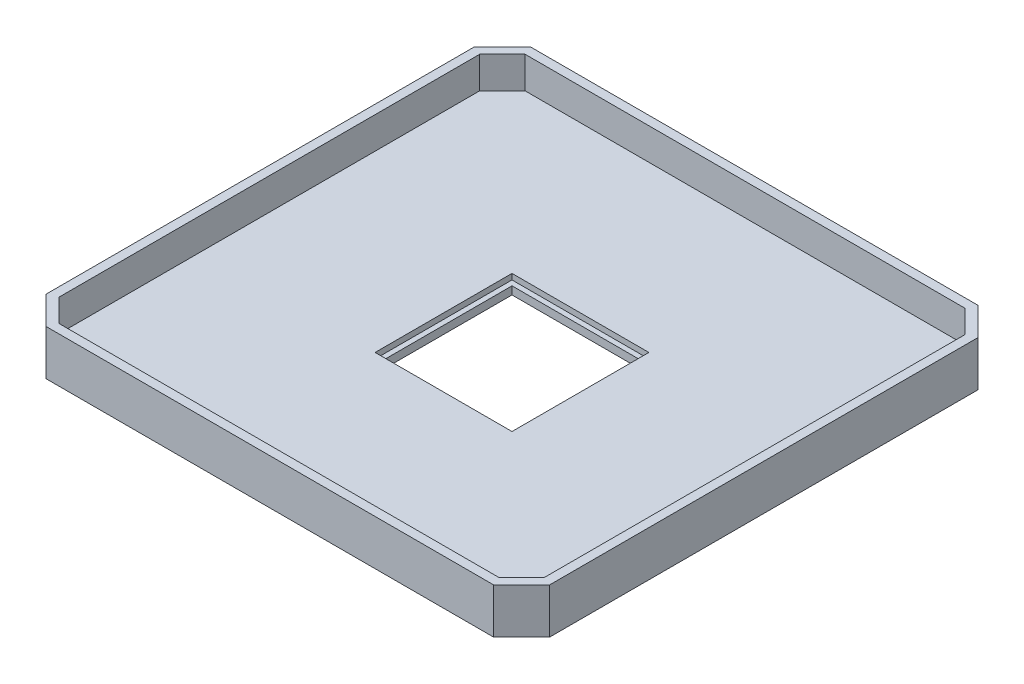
from build123d import *

# Parameters (mm, degrees)
EXTRUDED_WALLS_DEPTH    = 10
SKETCH2_W               = 28
SKETCH2_H               = 28
EXTRUDED_BOTTOM_DEPTH   = 3
SKETCH5_W               = 30.25
SKETCH5_H               = 30.25
SENSOR_GLASS_HOLE_DEPTH = 1.25


with BuildPart() as part:
    # Sketch1 → Extruded Walls (new body)
    with BuildSketch(Plane(origin=(0, 0, 0), x_dir=(1, 0, 0), z_dir=(0, 1, 0))):
        Polygon((-55.625, -47.328427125), (-55.625, 47.328427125), (-49.453427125, 53.5), (49.453427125, 53.5), (55.625, 47.328427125), (55.625, -47.328427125), (49.453427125, -53.5), (-49.453427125, -53.5), align=None)
        Polygon((48.625, 51.5), (53.625, 46.5), (53.625, -46.5), (48.625, -51.5), (-48.625, -51.5), (-53.625, -46.5), (-53.625, 46.5), (-48.625, 51.5), align=None, mode=Mode.SUBTRACT)
    extrude(amount=EXTRUDED_WALLS_DEPTH)

    # Sketch2 → Extruded Bottom (add)
    with BuildSketch(Plane.XZ):
        Polygon((48.625, 51.5), (53.625, 46.5), (53.625, -46.5), (48.625, -51.5), (-48.625, -51.5), (-53.625, -46.5), (-53.625, 46.5), (-48.625, 51.5), align=None)
        Rectangle(SKETCH2_W, SKETCH2_H, mode=Mode.SUBTRACT)
    extrude(amount=-EXTRUDED_BOTTOM_DEPTH)

    # Sketch5 → Sensor Glass Hole (cut)
    with BuildSketch(Plane(origin=(0, 3, 0), x_dir=(1, 0, 0), z_dir=(0, 1, 0))):
        Rectangle(SKETCH5_W, SKETCH5_H)
    extrude(amount=-SENSOR_GLASS_HOLE_DEPTH, mode=Mode.SUBTRACT)


solid = part.part
